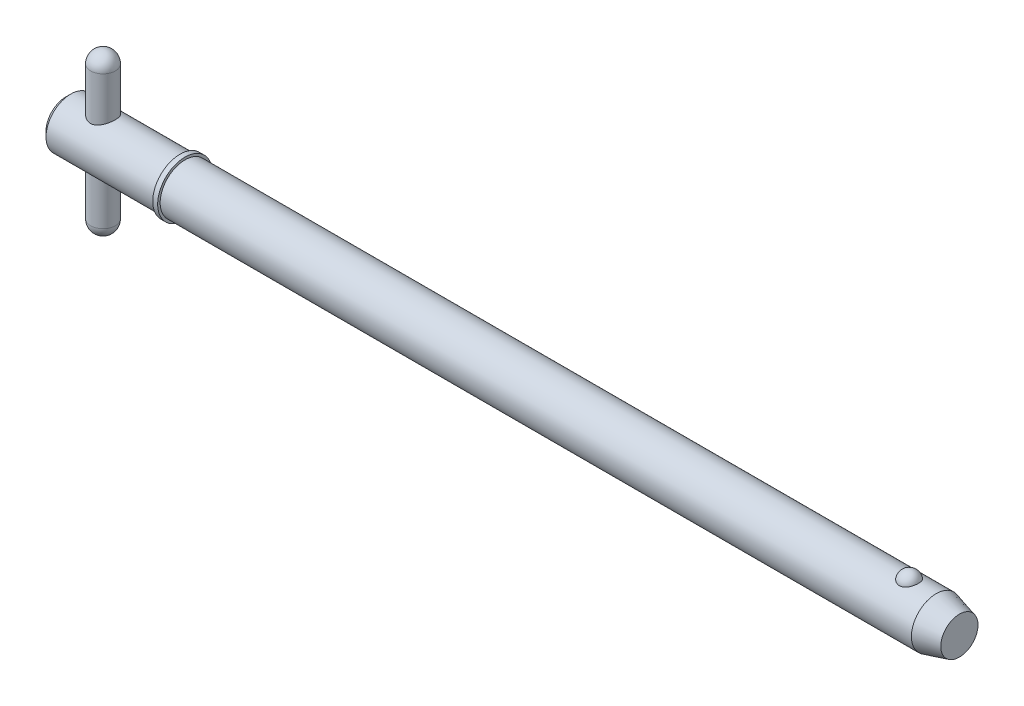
ISO-10303-21;
HEADER;
FILE_DESCRIPTION(('STEP AP214'),'2;1');
FILE_NAME('part.step','',(''),(''),'','','');
FILE_SCHEMA(('AUTOMOTIVE_DESIGN { 1 0 10303 214 1 1 1 1 }'));
ENDSEC;
DATA;
#1=APPLICATION_CONTEXT('core data for automotive mechanical design processes');
#2=APPLICATION_PROTOCOL_DEFINITION('international standard','automotive_design',2000,#1);
#3=PRODUCT_CONTEXT('',#1,'mechanical');
#4=PRODUCT('Part','Part','',(#3));
#5=PRODUCT_RELATED_PRODUCT_CATEGORY('part','',(#4));
#6=PRODUCT_DEFINITION_FORMATION('','',#4);
#7=PRODUCT_DEFINITION_CONTEXT('part definition',#1,'design');
#8=PRODUCT_DEFINITION('design','',#6,#7);
#9=PRODUCT_DEFINITION_SHAPE('','',#8);
#10=(LENGTH_UNIT() NAMED_UNIT(*) SI_UNIT(.MILLI.,.METRE.));
#11=(NAMED_UNIT(*) PLANE_ANGLE_UNIT() SI_UNIT($,.RADIAN.));
#12=(NAMED_UNIT(*) SI_UNIT($,.STERADIAN.) SOLID_ANGLE_UNIT());
#13=UNCERTAINTY_MEASURE_WITH_UNIT(LENGTH_MEASURE(1.E-05),#10,'distance_accuracy_value','');
#14=(GEOMETRIC_REPRESENTATION_CONTEXT(3) GLOBAL_UNCERTAINTY_ASSIGNED_CONTEXT((#13)) GLOBAL_UNIT_ASSIGNED_CONTEXT((#10,
#11,#12)) REPRESENTATION_CONTEXT('',''));
#15=CARTESIAN_POINT('',(0.,0.,0.));
#16=DIRECTION('',(0.,0.,1.));
#17=DIRECTION('',(1.,0.,0.));
#18=AXIS2_PLACEMENT_3D('',#15,#16,#17);
#19=CARTESIAN_POINT('',(5.94,12.7,0.));
#20=DIRECTION('',(0.,-1.,0.));
#21=DIRECTION('',(0.,0.,-1.));
#22=AXIS2_PLACEMENT_3D('',#19,#20,#21);
#23=CYLINDRICAL_SURFACE('',#22,1.98);
#24=CARTESIAN_POINT('',(5.94,-10.72,0.));
#25=DIRECTION('',(0.,-1.,0.));
#26=DIRECTION('',(0.,0.,-1.));
#27=AXIS2_PLACEMENT_3D('',#24,#25,#26);
#28=CIRCLE('',#27,1.98);
#29=CARTESIAN_POINT('',(5.94,-10.72,-1.98));
#30=VERTEX_POINT('',#29);
#31=EDGE_CURVE('P0_E10',#30,#30,#28,.F.);
#32=ORIENTED_EDGE('',*,*,#31,.T.);
#33=EDGE_LOOP('',(#32));
#34=FACE_BOUND('',#33,.T.);
#35=CARTESIAN_POINT('',(5.94,10.72,0.));
#36=DIRECTION('',(0.,-1.,0.));
#37=DIRECTION('',(0.,0.,-1.));
#38=AXIS2_PLACEMENT_3D('',#35,#36,#37);
#39=CIRCLE('',#38,1.98);
#40=CARTESIAN_POINT('',(5.94,10.72,-1.98));
#41=VERTEX_POINT('',#40);
#42=EDGE_CURVE('P0_E21',#41,#41,#39,.T.);
#43=ORIENTED_EDGE('',*,*,#42,.T.);
#44=EDGE_LOOP('',(#43));
#45=FACE_BOUND('',#44,.T.);
#46=ADVANCED_FACE('P0_F14',(#34,#45),#23,.T.);
#47=CARTESIAN_POINT('',(5.94,-10.72,0.));
#48=DIRECTION('',(0.,0.,1.));
#49=DIRECTION('',(1.,0.,0.));
#50=AXIS2_PLACEMENT_3D('',#47,#48,#49);
#51=SPHERICAL_SURFACE('',#50,1.98);
#52=CARTESIAN_POINT('',(5.94,-10.72,0.));
#53=DIRECTION('',(0.,-1.,0.));
#54=DIRECTION('',(0.,0.,-1.));
#55=AXIS2_PLACEMENT_3D('',#52,#53,#54);
#56=SPHERICAL_SURFACE('',#55,1.98);
#57=ORIENTED_EDGE('',*,*,#31,.F.);
#58=EDGE_LOOP('',(#57));
#59=FACE_BOUND('',#58,.T.);
#60=ADVANCED_FACE('P0_F29',(#59),#56,.T.);
#61=CARTESIAN_POINT('',(5.94,10.72,0.));
#62=DIRECTION('',(0.,0.,1.));
#63=DIRECTION('',(1.,0.,0.));
#64=AXIS2_PLACEMENT_3D('',#61,#62,#63);
#65=SPHERICAL_SURFACE('',#64,1.98);
#66=CARTESIAN_POINT('',(5.94,10.72,0.));
#67=DIRECTION('',(0.,-1.,0.));
#68=DIRECTION('',(0.,0.,-1.));
#69=AXIS2_PLACEMENT_3D('',#66,#67,#68);
#70=SPHERICAL_SURFACE('',#69,1.98);
#71=ORIENTED_EDGE('',*,*,#42,.F.);
#72=EDGE_LOOP('',(#71));
#73=FACE_BOUND('',#72,.T.);
#74=ADVANCED_FACE('P0_F16',(#73),#70,.T.);
#75=CLOSED_SHELL('',(#46,#60,#74));
#76=MANIFOLD_SOLID_BREP('P0_B1',#75);
#77=CARTESIAN_POINT('',(0.,0.,0.));
#78=DIRECTION('',(1.,0.,0.));
#79=DIRECTION('',(0.,0.,-1.));
#80=AXIS2_PLACEMENT_3D('',#77,#78,#79);
#81=CYLINDRICAL_SURFACE('',#80,3.97);
#82=CARTESIAN_POINT('',(139.175939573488,0.,0.));
#83=DIRECTION('',(1.,0.,0.));
#84=DIRECTION('',(0.,0.,-1.));
#85=AXIS2_PLACEMENT_3D('',#82,#83,#84);
#86=CIRCLE('',#85,3.97);
#87=CARTESIAN_POINT('',(139.175939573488,0.,-3.97));
#88=VERTEX_POINT('',#87);
#89=EDGE_CURVE('P1_E81',#88,#88,#86,.T.);
#90=ORIENTED_EDGE('',*,*,#89,.F.);
#91=EDGE_LOOP('',(#90));
#92=FACE_BOUND('',#91,.T.);
#93=CARTESIAN_POINT('',(19.05,0.,0.));
#94=DIRECTION('',(1.,0.,0.));
#95=DIRECTION('',(0.,0.,-1.));
#96=AXIS2_PLACEMENT_3D('',#93,#94,#95);
#97=CIRCLE('',#96,3.97);
#98=CARTESIAN_POINT('',(19.05,0.,-3.97));
#99=VERTEX_POINT('',#98);
#100=EDGE_CURVE('P1_E85',#99,#99,#97,.T.);
#101=ORIENTED_EDGE('',*,*,#100,.T.);
#102=EDGE_LOOP('',(#101));
#103=FACE_BOUND('',#102,.T.);
#104=CARTESIAN_POINT('',(134.845192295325,3.65715365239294,1.54470941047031));
#105=CARTESIAN_POINT('',(134.765244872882,3.65716001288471,1.54470290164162));
#106=CARTESIAN_POINT('',(134.685165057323,3.65987074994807,1.5383254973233));
#107=CARTESIAN_POINT('',(134.527237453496,3.67042218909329,1.51297018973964));
#108=CARTESIAN_POINT('',(134.44939614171,3.67827646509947,1.4939589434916));
#109=CARTESIAN_POINT('',(134.298461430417,3.69818848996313,1.44395950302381));
#110=CARTESIAN_POINT('',(134.225356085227,3.71023513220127,1.41300293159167));
#111=CARTESIAN_POINT('',(134.085563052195,3.73721833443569,1.34000212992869));
#112=CARTESIAN_POINT('',(134.018872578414,3.75215363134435,1.29796274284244));
#113=CARTESIAN_POINT('',(133.89148864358,3.78384968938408,1.20248834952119));
#114=CARTESIAN_POINT('',(133.831029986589,3.800651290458,1.14875388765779));
#115=CARTESIAN_POINT('',(133.719694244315,3.83398532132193,1.03205417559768));
#116=CARTESIAN_POINT('',(133.668820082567,3.85051766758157,0.969086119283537));
#117=CARTESIAN_POINT('',(133.575632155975,3.88238608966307,0.832526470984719));
#118=CARTESIAN_POINT('',(133.533796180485,3.89763698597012,0.758588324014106));
#119=CARTESIAN_POINT('',(133.462510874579,3.92451063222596,0.604352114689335));
#120=CARTESIAN_POINT('',(133.433062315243,3.93613315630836,0.524053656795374));
#121=CARTESIAN_POINT('',(133.386892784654,3.95467606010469,0.358403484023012));
#122=CARTESIAN_POINT('',(133.370312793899,3.96154426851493,0.273006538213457));
#123=CARTESIAN_POINT('',(133.350756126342,3.96967008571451,0.100408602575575));
#124=CARTESIAN_POINT('',(133.347778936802,3.97092790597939,0.0132076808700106));
#125=CARTESIAN_POINT('',(133.355458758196,3.96771794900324,-0.159844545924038));
#126=CARTESIAN_POINT('',(133.366016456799,3.96329187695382,-0.245701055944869));
#127=CARTESIAN_POINT('',(133.40038009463,3.94923163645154,-0.414277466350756));
#128=CARTESIAN_POINT('',(133.424186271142,3.93959737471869,-0.496997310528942));
#129=CARTESIAN_POINT('',(133.48461142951,3.91607752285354,-0.657113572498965));
#130=CARTESIAN_POINT('',(133.521249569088,3.90218558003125,-0.734501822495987));
#131=CARTESIAN_POINT('',(133.606593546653,3.87158287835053,-0.881704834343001));
#132=CARTESIAN_POINT('',(133.655300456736,3.85487186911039,-0.951518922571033));
#133=CARTESIAN_POINT('',(133.764116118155,3.82028735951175,-1.08208159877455));
#134=CARTESIAN_POINT('',(133.824295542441,3.80240713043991,-1.14276958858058));
#135=CARTESIAN_POINT('',(133.954493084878,3.76758161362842,-1.25282437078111));
#136=CARTESIAN_POINT('',(134.024510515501,3.75063626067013,-1.30219195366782));
#137=CARTESIAN_POINT('',(134.17118160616,3.71998948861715,-1.38729709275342));
#138=CARTESIAN_POINT('',(134.247681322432,3.70623183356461,-1.42327904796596));
#139=CARTESIAN_POINT('',(134.406298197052,3.68323188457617,-1.48178996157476));
#140=CARTESIAN_POINT('',(134.4884132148,3.67398788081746,-1.50432401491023));
#141=CARTESIAN_POINT('',(134.651481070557,3.66152163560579,-1.53440939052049));
#142=CARTESIAN_POINT('',(134.732284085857,3.65801951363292,-1.54265826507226));
#143=CARTESIAN_POINT('',(134.89420850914,3.65657341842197,-1.54608423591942));
#144=CARTESIAN_POINT('',(134.975329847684,3.65862829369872,-1.54126404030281));
#145=CARTESIAN_POINT('',(135.132812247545,3.66788969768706,-1.5190847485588));
#146=CARTESIAN_POINT('',(135.209242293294,3.67492621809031,-1.50213925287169));
#147=CARTESIAN_POINT('',(135.358041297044,3.69318404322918,-1.45666982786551));
#148=CARTESIAN_POINT('',(135.430409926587,3.7044056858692,-1.42814496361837));
#149=CARTESIAN_POINT('',(135.570802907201,3.73012749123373,-1.35956319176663));
#150=CARTESIAN_POINT('',(135.638700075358,3.74469307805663,-1.31927107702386));
#151=CARTESIAN_POINT('',(135.766864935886,3.77545272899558,-1.22847440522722));
#152=CARTESIAN_POINT('',(135.827130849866,3.79164717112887,-1.17796747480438));
#153=CARTESIAN_POINT('',(135.941634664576,3.82490325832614,-1.0651926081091));
#154=CARTESIAN_POINT('',(135.995413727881,3.84196735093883,-1.0024591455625));
#155=CARTESIAN_POINT('',(136.092098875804,3.87439863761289,-0.86871586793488));
#156=CARTESIAN_POINT('',(136.135003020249,3.88976552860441,-0.797704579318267));
#157=CARTESIAN_POINT('',(136.210266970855,3.91771381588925,-0.646896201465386));
#158=CARTESIAN_POINT('',(136.24225322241,3.93019255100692,-0.566893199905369));
#159=CARTESIAN_POINT('',(136.293110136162,3.95043886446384,-0.402255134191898));
#160=CARTESIAN_POINT('',(136.311980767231,3.95820643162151,-0.317620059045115));
#161=CARTESIAN_POINT('',(136.33621625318,3.96823733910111,-0.146156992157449));
#162=CARTESIAN_POINT('',(136.341587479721,3.970503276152,-0.0593300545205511));
#163=CARTESIAN_POINT('',(136.338730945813,3.96930811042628,0.114057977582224));
#164=CARTESIAN_POINT('',(136.330503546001,3.9658471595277,0.200619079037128));
#165=CARTESIAN_POINT('',(136.300706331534,3.95358562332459,0.370506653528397));
#166=CARTESIAN_POINT('',(136.27921294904,3.94481563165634,0.453848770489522));
#167=CARTESIAN_POINT('',(136.22338397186,3.92284586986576,0.615497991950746));
#168=CARTESIAN_POINT('',(136.189047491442,3.90964579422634,0.693804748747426));
#169=CARTESIAN_POINT('',(136.107970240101,3.88006987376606,0.843703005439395));
#170=CARTESIAN_POINT('',(136.061153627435,3.86367478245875,0.915249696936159));
#171=CARTESIAN_POINT('',(135.956189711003,3.82949741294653,1.04910810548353));
#172=CARTESIAN_POINT('',(135.898042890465,3.81171519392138,1.11142021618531));
#173=CARTESIAN_POINT('',(135.771743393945,3.7767336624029,1.22503948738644));
#174=CARTESIAN_POINT('',(135.703597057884,3.75953398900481,1.27635357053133));
#175=CARTESIAN_POINT('',(135.558900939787,3.72770506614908,1.36653336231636));
#176=CARTESIAN_POINT('',(135.482348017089,3.7130767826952,1.40539439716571));
#177=CARTESIAN_POINT('',(135.325759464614,3.68864287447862,1.4683048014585));
#178=CARTESIAN_POINT('',(135.245930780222,3.67869017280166,1.49281289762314));
#179=CARTESIAN_POINT('',(135.082987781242,3.66414535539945,1.52817474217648));
#180=CARTESIAN_POINT('',(134.999884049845,3.65953723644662,1.53906926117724));
#181=CARTESIAN_POINT('',(134.892776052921,3.65738948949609,1.54414878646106));
#182=CARTESIAN_POINT('',(134.868990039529,3.65715175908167,1.54471134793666));
#183=CARTESIAN_POINT('',(134.845192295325,3.65715365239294,1.54470941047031));
#184=B_SPLINE_CURVE_WITH_KNOTS('',3,(#104,#105,#106,#107,#108,#109,#110,#111,#112,#113,#114,
#115,#116,#117,#118,#119,#120,#121,#122,#123,#124,#125,#126,#127,#128,#129,#130,#131,#132,#133,
#134,#135,#136,#137,#138,#139,#140,#141,#142,#143,#144,#145,#146,#147,#148,#149,#150,#151,#152,
#153,#154,#155,#156,#157,#158,#159,#160,#161,#162,#163,#164,#165,#166,#167,#168,#169,#170,#171,
#172,#173,#174,#175,#176,#177,#178,#179,#180,#181,#182,#183),.UNSPECIFIED.,.T.,.F.,(4,2,2,2,2,2,
2,2,2,2,2,2,2,2,2,2,2,2,2,2,2,2,2,2,2,2,2,2,2,2,2,2,2,2,2,2,2,2,2,4),(0.,0.239777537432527,
0.48019041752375,0.719971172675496,0.959647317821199,1.20639040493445,1.45320863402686,
1.71093679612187,1.96868099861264,2.22921052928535,2.48973023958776,2.7483492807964,
3.0069729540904,3.2659844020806,3.5250188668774,3.78570385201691,4.0463706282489,
4.30201257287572,4.55755760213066,4.80022994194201,5.04285200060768,5.27757006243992,
5.5123070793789,5.75210128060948,5.9919512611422,6.24392810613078,6.49594987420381,
6.75588818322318,7.01582710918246,7.27564332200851,7.53545264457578,7.79377886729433,
8.05212290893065,8.3120741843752,8.57201437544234,8.83179046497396,9.0916639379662,
9.34270057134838,9.59298357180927,9.66435753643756),.UNSPECIFIED.);
#185=CARTESIAN_POINT('',(134.845192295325,3.65715365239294,1.54470941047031));
#186=VERTEX_POINT('',#185);
#187=EDGE_CURVE('P1_E35',#186,#186,#184,.T.);
#188=ORIENTED_EDGE('',*,*,#187,.T.);
#189=EDGE_LOOP('',(#188));
#190=FACE_BOUND('',#189,.T.);
#191=ADVANCED_FACE('P1_F13',(#92,#103,#190),#81,.T.);
#192=CARTESIAN_POINT('',(0.,0.,0.));
#193=DIRECTION('',(-1.,0.,0.));
#194=DIRECTION('',(0.,0.,1.));
#195=AXIS2_PLACEMENT_3D('',#192,#193,#194);
#196=PLANE('',#195);
#197=CARTESIAN_POINT('',(0.,0.,0.));
#198=DIRECTION('',(1.,0.,0.));
#199=DIRECTION('',(0.,0.,-1.));
#200=AXIS2_PLACEMENT_3D('',#197,#198,#199);
#201=CIRCLE('',#200,3.176);
#202=CARTESIAN_POINT('',(0.,0.,-3.176));
#203=VERTEX_POINT('',#202);
#204=EDGE_CURVE('P1_E9',#203,#203,#201,.T.);
#205=ORIENTED_EDGE('',*,*,#204,.F.);
#206=EDGE_LOOP('',(#205));
#207=FACE_BOUND('',#206,.T.);
#208=ADVANCED_FACE('P1_F15',(#207),#196,.T.);
#209=CARTESIAN_POINT('',(0.793999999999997,0.,0.));
#210=DIRECTION('',(1.,0.,0.));
#211=DIRECTION('',(0.,0.,-1.));
#212=AXIS2_PLACEMENT_3D('',#209,#210,#211);
#213=CONICAL_SURFACE('',#212,3.97,0.78539816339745);
#214=ORIENTED_EDGE('',*,*,#204,.T.);
#215=EDGE_LOOP('',(#214));
#216=FACE_BOUND('',#215,.T.);
#217=CARTESIAN_POINT('',(0.793999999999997,0.,0.));
#218=DIRECTION('',(1.,0.,0.));
#219=DIRECTION('',(0.,0.,-1.));
#220=AXIS2_PLACEMENT_3D('',#217,#218,#219);
#221=CIRCLE('',#220,3.97);
#222=CARTESIAN_POINT('',(0.793999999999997,0.,-3.97));
#223=VERTEX_POINT('',#222);
#224=EDGE_CURVE('P1_E26',#223,#223,#221,.T.);
#225=ORIENTED_EDGE('',*,*,#224,.F.);
#226=EDGE_LOOP('',(#225));
#227=FACE_BOUND('',#226,.T.);
#228=ADVANCED_FACE('P1_F77',(#216,#227),#213,.T.);
#229=CARTESIAN_POINT('',(0.,0.,0.));
#230=DIRECTION('',(1.,0.,0.));
#231=DIRECTION('',(0.,0.,-1.));
#232=AXIS2_PLACEMENT_3D('',#229,#230,#231);
#233=CYLINDRICAL_SURFACE('',#232,3.97);
#234=CARTESIAN_POINT('',(5.94,-3.44100276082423,1.98));
#235=CARTESIAN_POINT('',(5.8367885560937,-3.44101282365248,1.97999171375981));
#236=CARTESIAN_POINT('',(5.73344176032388,-3.44571749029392,1.97187534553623));
#237=CARTESIAN_POINT('',(5.52991905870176,-3.46385873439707,1.93981946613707));
#238=CARTESIAN_POINT('',(5.42975031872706,-3.47731375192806,1.91584653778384));
#239=CARTESIAN_POINT('',(5.23590869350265,-3.51100678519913,1.85336773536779));
#240=CARTESIAN_POINT('',(5.14220446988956,-3.53120882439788,1.81493880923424));
#241=CARTESIAN_POINT('',(4.9625969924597,-3.57606420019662,1.72487335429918));
#242=CARTESIAN_POINT('',(4.87669412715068,-3.6007177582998,1.67323616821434));
#243=CARTESIAN_POINT('',(4.70734412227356,-3.65417020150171,1.55325205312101));
#244=CARTESIAN_POINT('',(4.62467662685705,-3.68314323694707,1.4838818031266));
#245=CARTESIAN_POINT('',(4.47154355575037,-3.74056406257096,1.33252902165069));
#246=CARTESIAN_POINT('',(4.40108404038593,-3.76901158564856,1.25054026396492));
#247=CARTESIAN_POINT('',(4.26974803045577,-3.82445556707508,1.06956584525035));
#248=CARTESIAN_POINT('',(4.20982960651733,-3.8512271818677,0.969809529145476));
#249=CARTESIAN_POINT('',(4.10798077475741,-3.89804342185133,0.760047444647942));
#250=CARTESIAN_POINT('',(4.06603907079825,-3.91809226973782,0.650048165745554));
#251=CARTESIAN_POINT('',(4.00441878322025,-3.94794912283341,0.431181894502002));
#252=CARTESIAN_POINT('',(3.98337329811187,-3.95838209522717,0.322786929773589));
#253=CARTESIAN_POINT('',(3.9596425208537,-3.97016407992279,0.103541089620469));
#254=CARTESIAN_POINT('',(3.95694618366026,-3.97151855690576,-0.00730826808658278));
#255=CARTESIAN_POINT('',(3.9694599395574,-3.96528826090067,-0.218044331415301));
#256=CARTESIAN_POINT('',(3.98314071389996,-3.95846689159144,-0.318049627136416));
#257=CARTESIAN_POINT('',(4.02528522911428,-3.93780347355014,-0.514124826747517));
#258=CARTESIAN_POINT('',(4.05375007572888,-3.92396089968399,-0.61019443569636));
#259=CARTESIAN_POINT('',(4.12484256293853,-3.89028355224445,-0.797351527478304));
#260=CARTESIAN_POINT('',(4.16766142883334,-3.87036821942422,-0.888351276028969));
#261=CARTESIAN_POINT('',(4.26598377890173,-3.82634285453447,-1.06209448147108));
#262=CARTESIAN_POINT('',(4.32149181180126,-3.8022313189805,-1.14483496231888));
#263=CARTESIAN_POINT('',(4.44962332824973,-3.74940011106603,-1.30802500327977));
#264=CARTESIAN_POINT('',(4.52336636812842,-3.72046031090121,-1.38752498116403));
#265=CARTESIAN_POINT('',(4.68287656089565,-3.66269463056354,-1.53354043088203));
#266=CARTESIAN_POINT('',(4.7686527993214,-3.63386885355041,-1.60004599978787));
#267=CARTESIAN_POINT('',(4.9564069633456,-3.57763161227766,-1.72228426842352));
#268=CARTESIAN_POINT('',(5.05906485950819,-3.5504233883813,-1.77707534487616));
#269=CARTESIAN_POINT('',(5.27381412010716,-3.50334038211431,-1.86819784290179));
#270=CARTESIAN_POINT('',(5.38589553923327,-3.48345798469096,-1.90454844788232));
#271=CARTESIAN_POINT('',(5.6069795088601,-3.45548331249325,-1.95481643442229));
#272=CARTESIAN_POINT('',(5.71552407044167,-3.44658268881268,-1.97028113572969));
#273=CARTESIAN_POINT('',(5.93399639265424,-3.43928114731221,-1.98300600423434));
#274=CARTESIAN_POINT('',(6.04392313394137,-3.44087289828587,-1.98027888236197));
#275=CARTESIAN_POINT('',(6.24931618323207,-3.45351901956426,-1.95811780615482));
#276=CARTESIAN_POINT('',(6.34505668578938,-3.46352725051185,-1.94052989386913));
#277=CARTESIAN_POINT('',(6.53204702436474,-3.49033612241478,-1.89188242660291));
#278=CARTESIAN_POINT('',(6.62329540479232,-3.50713894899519,-1.86081853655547));
#279=CARTESIAN_POINT('',(6.80352105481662,-3.54655680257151,-1.78458666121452));
#280=CARTESIAN_POINT('',(6.89219712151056,-3.56940508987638,-1.73883178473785));
#281=CARTESIAN_POINT('',(7.06112449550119,-3.61813012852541,-1.63502913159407));
#282=CARTESIAN_POINT('',(7.14137144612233,-3.6440084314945,-1.57697504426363));
#283=CARTESIAN_POINT('',(7.30168083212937,-3.69977514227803,-1.44171920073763));
#284=CARTESIAN_POINT('',(7.38046039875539,-3.7297597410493,-1.36302972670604));
#285=CARTESIAN_POINT('',(7.52409649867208,-3.78754991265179,-1.19307190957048));
#286=CARTESIAN_POINT('',(7.58894840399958,-3.81535475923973,-1.10179940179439));
#287=CARTESIAN_POINT('',(7.70430122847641,-3.86658972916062,-0.906019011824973));
#288=CARTESIAN_POINT('',(7.75438714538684,-3.88988795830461,-0.801229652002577));
#289=CARTESIAN_POINT('',(7.83572184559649,-3.92848199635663,-0.583216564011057));
#290=CARTESIAN_POINT('',(7.86698708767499,-3.94378479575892,-0.470000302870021));
#291=CARTESIAN_POINT('',(7.90711051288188,-3.96355307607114,-0.249525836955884));
#292=CARTESIAN_POINT('',(7.91775648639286,-3.96888171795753,-0.142669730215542));
#293=CARTESIAN_POINT('',(7.92160247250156,-3.97079858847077,0.0714191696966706));
#294=CARTESIAN_POINT('',(7.91480852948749,-3.96738984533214,0.178651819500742));
#295=CARTESIAN_POINT('',(7.88515479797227,-3.9527181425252,0.383072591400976));
#296=CARTESIAN_POINT('',(7.8633739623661,-3.94198303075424,0.480459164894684));
#297=CARTESIAN_POINT('',(7.80581513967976,-3.91422178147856,0.670038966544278));
#298=CARTESIAN_POINT('',(7.77003513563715,-3.89719473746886,0.762231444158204));
#299=CARTESIAN_POINT('',(7.68389191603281,-3.85747818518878,0.943248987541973));
#300=CARTESIAN_POINT('',(7.63296879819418,-3.83457704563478,1.03175978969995));
#301=CARTESIAN_POINT('',(7.51869140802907,-3.7855122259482,1.19934744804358));
#302=CARTESIAN_POINT('',(7.45533142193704,-3.75934704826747,1.2784199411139));
#303=CARTESIAN_POINT('',(7.31068939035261,-3.70329841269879,1.433144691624));
#304=CARTESIAN_POINT('',(7.22825362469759,-3.67330340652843,1.50768183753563));
#305=CARTESIAN_POINT('',(7.05162367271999,-3.61514025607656,1.64226879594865));
#306=CARTESIAN_POINT('',(6.95741928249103,-3.58697372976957,1.70230590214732));
#307=CARTESIAN_POINT('',(6.75590859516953,-3.53504049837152,1.80775364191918));
#308=CARTESIAN_POINT('',(6.64828786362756,-3.51143624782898,1.85265616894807));
#309=CARTESIAN_POINT('',(6.48137774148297,-3.48289659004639,1.90544537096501));
#310=CARTESIAN_POINT('',(6.42488151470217,-3.4745323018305,1.9206071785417));
#311=CARTESIAN_POINT('',(6.31046920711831,-3.4604244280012,1.94591259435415));
#312=CARTESIAN_POINT('',(6.25255415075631,-3.45467900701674,1.95605971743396));
#313=CARTESIAN_POINT('',(6.1521444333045,-3.44728060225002,1.96905939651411));
#314=CARTESIAN_POINT('',(6.10985721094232,-3.44493297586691,1.97315742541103));
#315=CARTESIAN_POINT('',(6.02505433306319,-3.44179192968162,1.97862952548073));
#316=CARTESIAN_POINT('',(5.98253866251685,-3.44099861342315,1.98000341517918));
#317=CARTESIAN_POINT('',(5.94,-3.44100276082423,1.98));
#318=B_SPLINE_CURVE_WITH_KNOTS('',3,(#234,#235,#236,#237,#238,#239,#240,#241,#242,#243,#244,
#245,#246,#247,#248,#249,#250,#251,#252,#253,#254,#255,#256,#257,#258,#259,#260,#261,#262,#263,
#264,#265,#266,#267,#268,#269,#270,#271,#272,#273,#274,#275,#276,#277,#278,#279,#280,#281,#282,
#283,#284,#285,#286,#287,#288,#289,#290,#291,#292,#293,#294,#295,#296,#297,#298,#299,#300,#301,
#302,#303,#304,#305,#306,#307,#308,#309,#310,#311,#312,#313,#314,#315,#316,#317),.UNSPECIFIED.,
.T.,.F.,(4,2,2,2,2,2,2,2,2,2,2,2,2,2,2,2,2,2,2,2,2,2,2,2,2,2,2,2,2,2,2,2,2,2,2,2,2,2,2,2,2,4),
(0.,0.309462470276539,0.619579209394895,0.928068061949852,1.23657226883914,1.57038619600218,
1.90436536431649,2.26071614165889,2.61684266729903,2.94773555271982,3.27842924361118,
3.58050679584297,3.88260694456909,4.18890317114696,4.49530936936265,4.83057163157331,
5.1660884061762,5.52272472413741,5.87898927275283,6.20706708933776,6.53491569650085,
6.82716910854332,7.11951660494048,7.42541184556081,7.73146442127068,8.07586334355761,
8.42037652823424,8.77380887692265,9.12693169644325,9.44775848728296,9.76847409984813,
10.0682302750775,10.3680296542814,10.6806938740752,10.9935020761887,11.3373031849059,
11.6814044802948,12.0361164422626,12.2131519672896,12.3900632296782,12.5175998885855,
12.6451450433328),.UNSPECIFIED.);
#319=CARTESIAN_POINT('',(5.94,-3.44100276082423,1.98));
#320=VERTEX_POINT('',#319);
#321=EDGE_CURVE('P1_E17',#320,#320,#318,.T.);
#322=ORIENTED_EDGE('',*,*,#321,.F.);
#323=EDGE_LOOP('',(#322));
#324=FACE_BOUND('',#323,.T.);
#325=CARTESIAN_POINT('',(5.94,3.44100276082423,1.98));
#326=CARTESIAN_POINT('',(6.0432114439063,3.44101282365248,1.97999171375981));
#327=CARTESIAN_POINT('',(6.14655823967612,3.44571749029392,1.97187534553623));
#328=CARTESIAN_POINT('',(6.35008094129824,3.46385873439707,1.93981946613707));
#329=CARTESIAN_POINT('',(6.45024968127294,3.47731375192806,1.91584653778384));
#330=CARTESIAN_POINT('',(6.64409130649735,3.51100678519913,1.85336773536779));
#331=CARTESIAN_POINT('',(6.73779553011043,3.53120882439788,1.81493880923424));
#332=CARTESIAN_POINT('',(6.91740300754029,3.57606420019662,1.72487335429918));
#333=CARTESIAN_POINT('',(7.00330587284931,3.6007177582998,1.67323616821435));
#334=CARTESIAN_POINT('',(7.17265587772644,3.65417020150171,1.55325205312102));
#335=CARTESIAN_POINT('',(7.25532337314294,3.68314323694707,1.4838818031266));
#336=CARTESIAN_POINT('',(7.40845644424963,3.74056406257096,1.3325290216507));
#337=CARTESIAN_POINT('',(7.47891595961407,3.76901158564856,1.25054026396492));
#338=CARTESIAN_POINT('',(7.61025196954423,3.82445556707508,1.06956584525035));
#339=CARTESIAN_POINT('',(7.67017039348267,3.8512271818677,0.969809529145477));
#340=CARTESIAN_POINT('',(7.77201922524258,3.89804342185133,0.760047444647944));
#341=CARTESIAN_POINT('',(7.81396092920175,3.91809226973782,0.650048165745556));
#342=CARTESIAN_POINT('',(7.87558121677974,3.94794912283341,0.431181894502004));
#343=CARTESIAN_POINT('',(7.89662670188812,3.95838209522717,0.322786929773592));
#344=CARTESIAN_POINT('',(7.9203574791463,3.97016407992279,0.103541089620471));
#345=CARTESIAN_POINT('',(7.92305381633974,3.97151855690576,-0.00730826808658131));
#346=CARTESIAN_POINT('',(7.9105400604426,3.96528826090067,-0.2180443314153));
#347=CARTESIAN_POINT('',(7.89685928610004,3.95846689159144,-0.318049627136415));
#348=CARTESIAN_POINT('',(7.85471477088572,3.93780347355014,-0.514124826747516));
#349=CARTESIAN_POINT('',(7.82624992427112,3.92396089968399,-0.61019443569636));
#350=CARTESIAN_POINT('',(7.75515743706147,3.89028355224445,-0.797351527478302));
#351=CARTESIAN_POINT('',(7.71233857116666,3.87036821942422,-0.888351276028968));
#352=CARTESIAN_POINT('',(7.61401622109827,3.82634285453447,-1.06209448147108));
#353=CARTESIAN_POINT('',(7.55850818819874,3.8022313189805,-1.14483496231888));
#354=CARTESIAN_POINT('',(7.43037667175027,3.74940011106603,-1.30802500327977));
#355=CARTESIAN_POINT('',(7.35663363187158,3.72046031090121,-1.38752498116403));
#356=CARTESIAN_POINT('',(7.19712343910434,3.66269463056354,-1.53354043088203));
#357=CARTESIAN_POINT('',(7.1113472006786,3.63386885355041,-1.60004599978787));
#358=CARTESIAN_POINT('',(6.9235930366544,3.57763161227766,-1.72228426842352));
#359=CARTESIAN_POINT('',(6.82093514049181,3.5504233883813,-1.77707534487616));
#360=CARTESIAN_POINT('',(6.60618587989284,3.50334038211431,-1.86819784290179));
#361=CARTESIAN_POINT('',(6.49410446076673,3.48345798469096,-1.90454844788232));
#362=CARTESIAN_POINT('',(6.2730204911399,3.45548331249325,-1.95481643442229));
#363=CARTESIAN_POINT('',(6.16447592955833,3.44658268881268,-1.97028113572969));
#364=CARTESIAN_POINT('',(5.94600360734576,3.43928114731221,-1.98300600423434));
#365=CARTESIAN_POINT('',(5.83607686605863,3.44087289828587,-1.98027888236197));
#366=CARTESIAN_POINT('',(5.63068381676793,3.45351901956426,-1.95811780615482));
#367=CARTESIAN_POINT('',(5.53494331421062,3.46352725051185,-1.94052989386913));
#368=CARTESIAN_POINT('',(5.34795297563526,3.49033612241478,-1.89188242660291));
#369=CARTESIAN_POINT('',(5.25670459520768,3.50713894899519,-1.86081853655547));
#370=CARTESIAN_POINT('',(5.07647894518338,3.54655680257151,-1.78458666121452));
#371=CARTESIAN_POINT('',(4.98780287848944,3.56940508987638,-1.73883178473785));
#372=CARTESIAN_POINT('',(4.81887550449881,3.61813012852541,-1.63502913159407));
#373=CARTESIAN_POINT('',(4.73862855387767,3.6440084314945,-1.57697504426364));
#374=CARTESIAN_POINT('',(4.57831916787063,3.69977514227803,-1.44171920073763));
#375=CARTESIAN_POINT('',(4.49953960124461,3.7297597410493,-1.36302972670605));
#376=CARTESIAN_POINT('',(4.35590350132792,3.78754991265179,-1.19307190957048));
#377=CARTESIAN_POINT('',(4.29105159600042,3.81535475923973,-1.10179940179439));
#378=CARTESIAN_POINT('',(4.17569877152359,3.86658972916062,-0.906019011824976));
#379=CARTESIAN_POINT('',(4.12561285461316,3.88988795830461,-0.80122965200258));
#380=CARTESIAN_POINT('',(4.04427815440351,3.92848199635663,-0.58321656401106));
#381=CARTESIAN_POINT('',(4.01301291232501,3.94378479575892,-0.470000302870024));
#382=CARTESIAN_POINT('',(3.97288948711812,3.96355307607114,-0.249525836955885));
#383=CARTESIAN_POINT('',(3.96224351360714,3.96888171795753,-0.142669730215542));
#384=CARTESIAN_POINT('',(3.95839752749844,3.97079858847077,0.0714191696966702));
#385=CARTESIAN_POINT('',(3.96519147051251,3.96738984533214,0.178651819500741));
#386=CARTESIAN_POINT('',(3.99484520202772,3.9527181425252,0.383072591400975));
#387=CARTESIAN_POINT('',(4.01662603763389,3.94198303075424,0.480459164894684));
#388=CARTESIAN_POINT('',(4.07418486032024,3.91422178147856,0.670038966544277));
#389=CARTESIAN_POINT('',(4.10996486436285,3.89719473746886,0.762231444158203));
#390=CARTESIAN_POINT('',(4.19610808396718,3.85747818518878,0.943248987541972));
#391=CARTESIAN_POINT('',(4.24703120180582,3.83457704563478,1.03175978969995));
#392=CARTESIAN_POINT('',(4.36130859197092,3.7855122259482,1.19934744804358));
#393=CARTESIAN_POINT('',(4.42466857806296,3.75934704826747,1.2784199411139));
#394=CARTESIAN_POINT('',(4.56931060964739,3.70329841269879,1.433144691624));
#395=CARTESIAN_POINT('',(4.65174637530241,3.67330340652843,1.50768183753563));
#396=CARTESIAN_POINT('',(4.82837632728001,3.61514025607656,1.64226879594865));
#397=CARTESIAN_POINT('',(4.92258071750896,3.58697372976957,1.70230590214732));
#398=CARTESIAN_POINT('',(5.12409140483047,3.53504049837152,1.80775364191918));
#399=CARTESIAN_POINT('',(5.23171213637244,3.51143624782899,1.85265616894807));
#400=CARTESIAN_POINT('',(5.39862225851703,3.48289659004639,1.90544537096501));
#401=CARTESIAN_POINT('',(5.45511848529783,3.4745323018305,1.9206071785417));
#402=CARTESIAN_POINT('',(5.56953079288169,3.4604244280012,1.94591259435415));
#403=CARTESIAN_POINT('',(5.62744584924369,3.45467900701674,1.95605971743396));
#404=CARTESIAN_POINT('',(5.7278555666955,3.44728060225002,1.9690593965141));
#405=CARTESIAN_POINT('',(5.77014278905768,3.44493297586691,1.97315742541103));
#406=CARTESIAN_POINT('',(5.85494566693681,3.44179192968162,1.97862952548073));
#407=CARTESIAN_POINT('',(5.89746133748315,3.44099861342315,1.98000341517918));
#408=CARTESIAN_POINT('',(5.94,3.44100276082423,1.98));
#409=B_SPLINE_CURVE_WITH_KNOTS('',3,(#325,#326,#327,#328,#329,#330,#331,#332,#333,#334,#335,
#336,#337,#338,#339,#340,#341,#342,#343,#344,#345,#346,#347,#348,#349,#350,#351,#352,#353,#354,
#355,#356,#357,#358,#359,#360,#361,#362,#363,#364,#365,#366,#367,#368,#369,#370,#371,#372,#373,
#374,#375,#376,#377,#378,#379,#380,#381,#382,#383,#384,#385,#386,#387,#388,#389,#390,#391,#392,
#393,#394,#395,#396,#397,#398,#399,#400,#401,#402,#403,#404,#405,#406,#407,#408),.UNSPECIFIED.,
.T.,.F.,(4,2,2,2,2,2,2,2,2,2,2,2,2,2,2,2,2,2,2,2,2,2,2,2,2,2,2,2,2,2,2,2,2,2,2,2,2,2,2,2,2,4),
(0.,0.309462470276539,0.619579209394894,0.928068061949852,1.23657226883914,1.57038619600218,
1.90436536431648,2.26071614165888,2.61684266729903,2.94773555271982,3.27842924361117,
3.58050679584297,3.88260694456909,4.18890317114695,4.49530936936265,4.83057163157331,
5.1660884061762,5.5227247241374,5.87898927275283,6.20706708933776,6.53491569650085,
6.82716910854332,7.11951660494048,7.42541184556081,7.73146442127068,8.07586334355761,
8.42037652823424,8.77380887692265,9.12693169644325,9.44775848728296,9.76847409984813,
10.0682302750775,10.3680296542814,10.6806938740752,10.9935020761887,11.3373031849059,
11.6814044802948,12.0361164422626,12.2131519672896,12.3900632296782,12.5175998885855,
12.6451450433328),.UNSPECIFIED.);
#410=CARTESIAN_POINT('',(5.94,3.44100276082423,1.98));
#411=VERTEX_POINT('',#410);
#412=EDGE_CURVE('P1_E43',#411,#411,#409,.T.);
#413=ORIENTED_EDGE('',*,*,#412,.F.);
#414=EDGE_LOOP('',(#413));
#415=FACE_BOUND('',#414,.T.);
#416=ORIENTED_EDGE('',*,*,#224,.T.);
#417=EDGE_LOOP('',(#416));
#418=FACE_BOUND('',#417,.T.);
#419=CARTESIAN_POINT('',(18.256,0.,0.));
#420=DIRECTION('',(1.,0.,0.));
#421=DIRECTION('',(0.,0.,-1.));
#422=AXIS2_PLACEMENT_3D('',#419,#420,#421);
#423=CIRCLE('',#422,3.97);
#424=CARTESIAN_POINT('',(18.256,0.,-3.97));
#425=VERTEX_POINT('',#424);
#426=EDGE_CURVE('P1_E31',#425,#425,#423,.T.);
#427=ORIENTED_EDGE('',*,*,#426,.F.);
#428=EDGE_LOOP('',(#427));
#429=FACE_BOUND('',#428,.T.);
#430=ADVANCED_FACE('P1_F103',(#324,#415,#418,#429),#233,.T.);
#431=CARTESIAN_POINT('',(18.256,3.97,0.));
#432=DIRECTION('',(-1.,0.,0.));
#433=DIRECTION('',(0.,0.,1.));
#434=AXIS2_PLACEMENT_3D('',#431,#432,#433);
#435=PLANE('',#434);
#436=ORIENTED_EDGE('',*,*,#426,.T.);
#437=EDGE_LOOP('',(#436));
#438=FACE_BOUND('',#437,.T.);
#439=CARTESIAN_POINT('',(18.256,0.,0.));
#440=DIRECTION('',(1.,0.,0.));
#441=DIRECTION('',(0.,0.,-1.));
#442=AXIS2_PLACEMENT_3D('',#439,#440,#441);
#443=CIRCLE('',#442,4.367);
#444=CARTESIAN_POINT('',(18.256,0.,-4.367));
#445=VERTEX_POINT('',#444);
#446=EDGE_CURVE('P1_E91',#445,#445,#443,.T.);
#447=ORIENTED_EDGE('',*,*,#446,.F.);
#448=EDGE_LOOP('',(#447));
#449=FACE_BOUND('',#448,.T.);
#450=ADVANCED_FACE('P1_F100',(#438,#449),#435,.T.);
#451=CARTESIAN_POINT('',(0.,0.,0.));
#452=DIRECTION('',(1.,0.,0.));
#453=DIRECTION('',(0.,0.,-1.));
#454=AXIS2_PLACEMENT_3D('',#451,#452,#453);
#455=CYLINDRICAL_SURFACE('',#454,4.367);
#456=ORIENTED_EDGE('',*,*,#446,.T.);
#457=EDGE_LOOP('',(#456));
#458=FACE_BOUND('',#457,.T.);
#459=CARTESIAN_POINT('',(19.05,0.,0.));
#460=DIRECTION('',(1.,0.,0.));
#461=DIRECTION('',(0.,0.,-1.));
#462=AXIS2_PLACEMENT_3D('',#459,#460,#461);
#463=CIRCLE('',#462,4.367);
#464=CARTESIAN_POINT('',(19.05,0.,-4.367));
#465=VERTEX_POINT('',#464);
#466=EDGE_CURVE('P1_E88',#465,#465,#463,.T.);
#467=ORIENTED_EDGE('',*,*,#466,.F.);
#468=EDGE_LOOP('',(#467));
#469=FACE_BOUND('',#468,.T.);
#470=ADVANCED_FACE('P1_F68',(#458,#469),#455,.T.);
#471=CARTESIAN_POINT('',(19.05,4.367,0.));
#472=DIRECTION('',(1.,0.,0.));
#473=DIRECTION('',(0.,0.,-1.));
#474=AXIS2_PLACEMENT_3D('',#471,#472,#473);
#475=PLANE('',#474);
#476=ORIENTED_EDGE('',*,*,#466,.T.);
#477=EDGE_LOOP('',(#476));
#478=FACE_BOUND('',#477,.T.);
#479=ORIENTED_EDGE('',*,*,#100,.F.);
#480=EDGE_LOOP('',(#479));
#481=FACE_BOUND('',#480,.T.);
#482=ADVANCED_FACE('P1_F62',(#478,#481),#475,.T.);
#483=CARTESIAN_POINT('',(142.88,0.,0.));
#484=DIRECTION('',(-1.,0.,0.));
#485=DIRECTION('',(0.,0.,1.));
#486=AXIS2_PLACEMENT_3D('',#483,#484,#485);
#487=CONICAL_SURFACE('',#486,2.97750000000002,0.26179938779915);
#488=ORIENTED_EDGE('',*,*,#89,.T.);
#489=EDGE_LOOP('',(#488));
#490=FACE_BOUND('',#489,.T.);
#491=CARTESIAN_POINT('',(142.88,0.,0.));
#492=DIRECTION('',(1.,0.,0.));
#493=DIRECTION('',(0.,0.,-1.));
#494=AXIS2_PLACEMENT_3D('',#491,#492,#493);
#495=CIRCLE('',#494,2.97750000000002);
#496=CARTESIAN_POINT('',(142.88,0.,-2.97750000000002));
#497=VERTEX_POINT('',#496);
#498=EDGE_CURVE('P1_E42',#497,#497,#495,.T.);
#499=ORIENTED_EDGE('',*,*,#498,.F.);
#500=EDGE_LOOP('',(#499));
#501=FACE_BOUND('',#500,.T.);
#502=ADVANCED_FACE('P1_F59',(#490,#501),#487,.T.);
#503=CARTESIAN_POINT('',(142.88,2.97750000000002,0.));
#504=DIRECTION('',(1.,0.,0.));
#505=DIRECTION('',(0.,0.,-1.));
#506=AXIS2_PLACEMENT_3D('',#503,#504,#505);
#507=PLANE('',#506);
#508=ORIENTED_EDGE('',*,*,#498,.T.);
#509=EDGE_LOOP('',(#508));
#510=FACE_BOUND('',#509,.T.);
#511=ADVANCED_FACE('P1_F55',(#510),#507,.T.);
#512=CARTESIAN_POINT('',(134.845192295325,3.573,0.));
#513=DIRECTION('',(-1.,0.,0.));
#514=DIRECTION('',(0.,-1.,0.));
#515=AXIS2_PLACEMENT_3D('',#512,#513,#514);
#516=SPHERICAL_SURFACE('',#515,1.54700000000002);
#517=ORIENTED_EDGE('',*,*,#187,.F.);
#518=EDGE_LOOP('',(#517));
#519=FACE_BOUND('',#518,.T.);
#520=ADVANCED_FACE('P1_F50',(#519),#516,.T.);
#521=CARTESIAN_POINT('',(5.94,-4.367,0.));
#522=DIRECTION('',(0.,1.,0.));
#523=DIRECTION('',(0.,0.,1.));
#524=AXIS2_PLACEMENT_3D('',#521,#522,#523);
#525=CYLINDRICAL_SURFACE('',#524,1.98);
#526=ORIENTED_EDGE('',*,*,#321,.T.);
#527=EDGE_LOOP('',(#526));
#528=FACE_BOUND('',#527,.T.);
#529=ORIENTED_EDGE('',*,*,#412,.T.);
#530=EDGE_LOOP('',(#529));
#531=FACE_BOUND('',#530,.T.);
#532=ADVANCED_FACE('P1_F54',(#528,#531),#525,.F.);
#533=CLOSED_SHELL('',(#191,#208,#228,#430,#450,#470,#482,#502,#511,#520,#532));
#534=MANIFOLD_SOLID_BREP('P1_B1',#533);
#535=ADVANCED_BREP_SHAPE_REPRESENTATION('',(#18,#76,#534),#14);
#536=SHAPE_DEFINITION_REPRESENTATION(#9,#535);
ENDSEC;
END-ISO-10303-21;
